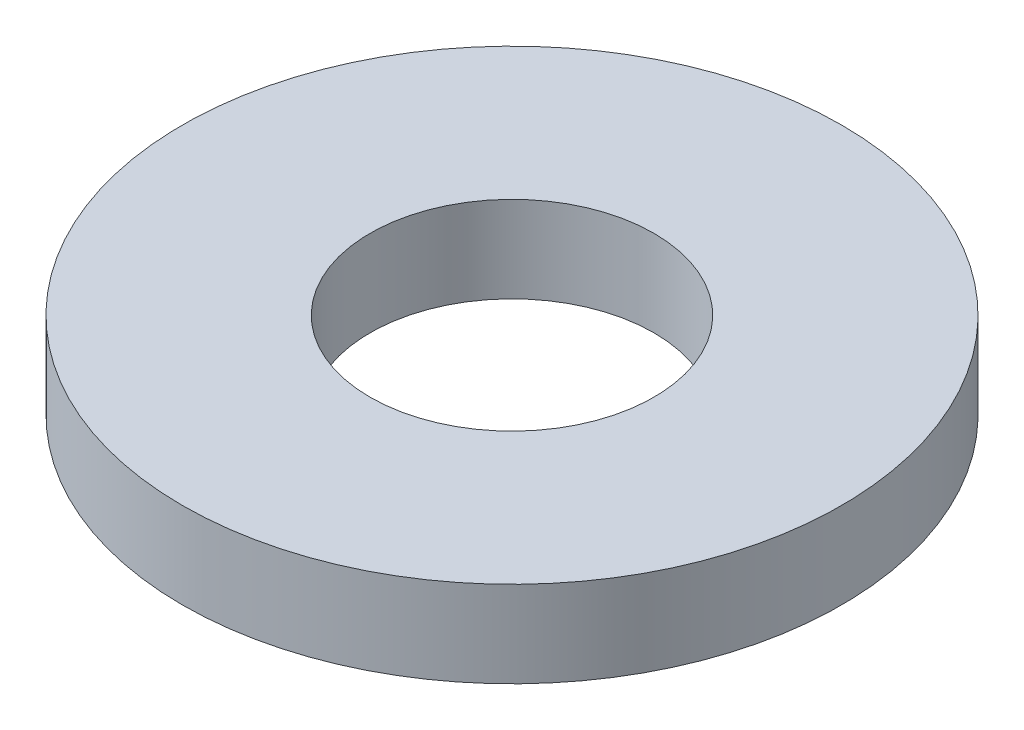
from build123d import *

# Parameters (mm, degrees)
SKETCH1_R           = 8.255
SKETCH1_R_2         = 3.556
BOSS_EXTRUDE1_DEPTH = 2.159


with BuildPart() as part:
    # Sketch1 → Boss-Extrude1 (new body)
    with BuildSketch(Plane(origin=(0, 0, 0), x_dir=(1, 0, 0), z_dir=(0, 1, 0))):
        with Locations(Location((0, 0, 0), (0, 0, 270))):
            Circle(SKETCH1_R)
        with Locations(Location((0, 0, 0), (0, 0, 270))):
            Circle(SKETCH1_R_2, mode=Mode.SUBTRACT)
    extrude(amount=BOSS_EXTRUDE1_DEPTH)


solid = part.part
